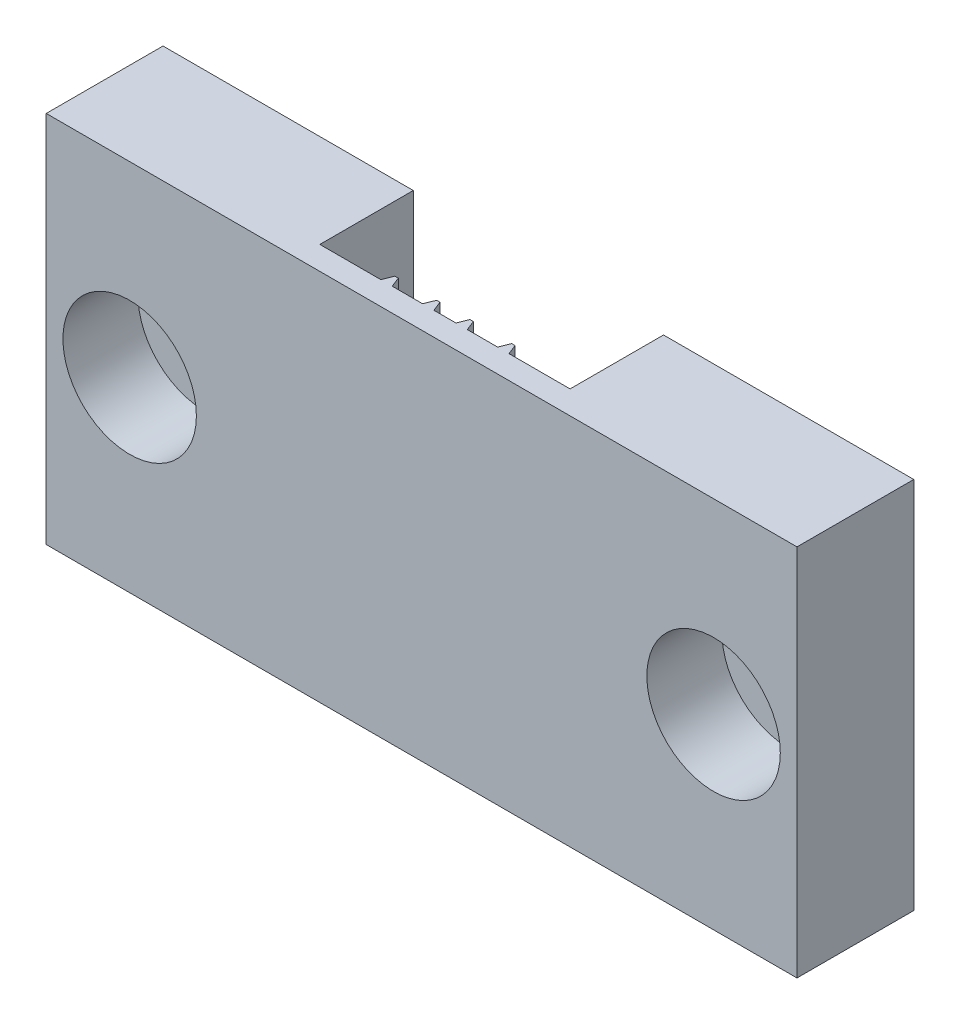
ISO-10303-21;
HEADER;
FILE_DESCRIPTION(('STEP AP214'),'2;1');
FILE_NAME('part.step','',(''),(''),'','','');
FILE_SCHEMA(('AUTOMOTIVE_DESIGN { 1 0 10303 214 1 1 1 1 }'));
ENDSEC;
DATA;
#1=APPLICATION_CONTEXT('core data for automotive mechanical design processes');
#2=APPLICATION_PROTOCOL_DEFINITION('international standard','automotive_design',2000,#1);
#3=PRODUCT_CONTEXT('',#1,'mechanical');
#4=PRODUCT('Part','Part','',(#3));
#5=PRODUCT_RELATED_PRODUCT_CATEGORY('part','',(#4));
#6=PRODUCT_DEFINITION_FORMATION('','',#4);
#7=PRODUCT_DEFINITION_CONTEXT('part definition',#1,'design');
#8=PRODUCT_DEFINITION('design','',#6,#7);
#9=PRODUCT_DEFINITION_SHAPE('','',#8);
#10=(LENGTH_UNIT() NAMED_UNIT(*) SI_UNIT(.MILLI.,.METRE.));
#11=(NAMED_UNIT(*) PLANE_ANGLE_UNIT() SI_UNIT($,.RADIAN.));
#12=(NAMED_UNIT(*) SI_UNIT($,.STERADIAN.) SOLID_ANGLE_UNIT());
#13=UNCERTAINTY_MEASURE_WITH_UNIT(LENGTH_MEASURE(1.E-05),#10,'distance_accuracy_value','');
#14=(GEOMETRIC_REPRESENTATION_CONTEXT(3) GLOBAL_UNCERTAINTY_ASSIGNED_CONTEXT((#13)) GLOBAL_UNIT_ASSIGNED_CONTEXT((#10,
#11,#12)) REPRESENTATION_CONTEXT('',''));
#15=CARTESIAN_POINT('',(0.,0.,0.));
#16=DIRECTION('',(0.,0.,1.));
#17=DIRECTION('',(1.,0.,0.));
#18=AXIS2_PLACEMENT_3D('',#15,#16,#17);
#19=CARTESIAN_POINT('',(45.,1.13686837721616E-13,0.));
#20=DIRECTION('',(0.,0.,1.));
#21=DIRECTION('',(1.,0.,0.));
#22=AXIS2_PLACEMENT_3D('',#19,#20,#21);
#23=PLANE('',#22);
#24=CARTESIAN_POINT('',(5.,11.1800003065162,0.));
#25=DIRECTION('',(0.,0.,1.));
#26=DIRECTION('',(1.,0.,0.));
#27=AXIS2_PLACEMENT_3D('',#24,#25,#26);
#28=CIRCLE('',#27,2.25);
#29=CARTESIAN_POINT('',(7.25,11.1800003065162,0.));
#30=VERTEX_POINT('',#29);
#31=EDGE_CURVE('E232',#30,#30,#28,.T.);
#32=ORIENTED_EDGE('',*,*,#31,.T.);
#33=EDGE_LOOP('',(#32));
#34=FACE_BOUND('',#33,.T.);
#35=DIRECTION('',(0.,1.,0.));
#36=VECTOR('',#35,1.);
#37=CARTESIAN_POINT('',(15.,1.14491749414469E-13,0.));
#38=LINE('',#37,#36);
#39=CARTESIAN_POINT('',(15.,1.14491749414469E-13,0.));
#40=VERTEX_POINT('',#39);
#41=CARTESIAN_POINT('',(15.,22.3800003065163,0.));
#42=VERTEX_POINT('',#41);
#43=EDGE_CURVE('E337',#40,#42,#38,.T.);
#44=ORIENTED_EDGE('',*,*,#43,.F.);
#45=DIRECTION('',(1.,0.,0.));
#46=VECTOR('',#45,1.);
#47=CARTESIAN_POINT('',(0.,1.13686837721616E-13,0.));
#48=LINE('',#47,#46);
#49=CARTESIAN_POINT('',(0.,1.13686837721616E-13,0.));
#50=VERTEX_POINT('',#49);
#51=EDGE_CURVE('E231',#50,#40,#48,.T.);
#52=ORIENTED_EDGE('',*,*,#51,.F.);
#53=DIRECTION('',(0.,-1.,0.));
#54=VECTOR('',#53,1.);
#55=CARTESIAN_POINT('',(0.,1.13686837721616E-13,0.));
#56=LINE('',#55,#54);
#57=CARTESIAN_POINT('',(0.,22.3800003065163,0.));
#58=VERTEX_POINT('',#57);
#59=EDGE_CURVE('E80',#58,#50,#56,.T.);
#60=ORIENTED_EDGE('',*,*,#59,.F.);
#61=DIRECTION('',(-1.,0.,0.));
#62=VECTOR('',#61,1.);
#63=CARTESIAN_POINT('',(0.,22.3800003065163,0.));
#64=LINE('',#63,#62);
#65=EDGE_CURVE('E242',#42,#58,#64,.T.);
#66=ORIENTED_EDGE('',*,*,#65,.F.);
#67=EDGE_LOOP('',(#44,#52,#60,#66));
#68=FACE_BOUND('',#67,.T.);
#69=ADVANCED_FACE('F33',(#34,#68),#23,.F.);
#70=CARTESIAN_POINT('',(40.,11.1800003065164,0.));
#71=DIRECTION('',(0.,0.,1.));
#72=DIRECTION('',(1.,0.,0.));
#73=AXIS2_PLACEMENT_3D('',#70,#71,#72);
#74=CIRCLE('',#73,2.25);
#75=CARTESIAN_POINT('',(42.25,11.1800003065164,0.));
#76=VERTEX_POINT('',#75);
#77=EDGE_CURVE('E236',#76,#76,#74,.T.);
#78=ORIENTED_EDGE('',*,*,#77,.T.);
#79=EDGE_LOOP('',(#78));
#80=FACE_BOUND('',#79,.T.);
#81=DIRECTION('',(0.,1.,0.));
#82=VECTOR('',#81,1.);
#83=CARTESIAN_POINT('',(30.,1.14491749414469E-13,0.));
#84=LINE('',#83,#82);
#85=CARTESIAN_POINT('',(30.,1.14491749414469E-13,0.));
#86=VERTEX_POINT('',#85);
#87=CARTESIAN_POINT('',(30.,22.3800003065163,0.));
#88=VERTEX_POINT('',#87);
#89=EDGE_CURVE('E205',#86,#88,#84,.T.);
#90=ORIENTED_EDGE('',*,*,#89,.T.);
#91=CARTESIAN_POINT('',(45.,22.3800003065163,0.));
#92=VERTEX_POINT('',#91);
#93=EDGE_CURVE('E243',#92,#88,#64,.T.);
#94=ORIENTED_EDGE('',*,*,#93,.F.);
#95=DIRECTION('',(0.,1.,0.));
#96=VECTOR('',#95,1.);
#97=CARTESIAN_POINT('',(45.,1.13686837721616E-13,0.));
#98=LINE('',#97,#96);
#99=CARTESIAN_POINT('',(45.,1.13686837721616E-13,0.));
#100=VERTEX_POINT('',#99);
#101=EDGE_CURVE('E230',#100,#92,#98,.T.);
#102=ORIENTED_EDGE('',*,*,#101,.F.);
#103=EDGE_CURVE('E222',#86,#100,#48,.T.);
#104=ORIENTED_EDGE('',*,*,#103,.F.);
#105=EDGE_LOOP('',(#90,#94,#102,#104));
#106=FACE_BOUND('',#105,.T.);
#107=ADVANCED_FACE('F229',(#80,#106),#23,.F.);
#108=CARTESIAN_POINT('',(0.,1.13686837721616E-13,7.));
#109=DIRECTION('',(0.,1.,0.));
#110=DIRECTION('',(0.,0.,1.));
#111=AXIS2_PLACEMENT_3D('',#108,#109,#110);
#112=PLANE('',#111);
#113=DIRECTION('',(0.,0.,-1.));
#114=VECTOR('',#113,1.);
#115=CARTESIAN_POINT('',(15.,1.14491749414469E-13,5.59999999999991));
#116=LINE('',#115,#114);
#117=CARTESIAN_POINT('',(15.,1.14491749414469E-13,5.59999999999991));
#118=VERTEX_POINT('',#117);
#119=EDGE_CURVE('E217',#118,#40,#116,.T.);
#120=ORIENTED_EDGE('',*,*,#119,.F.);
#121=DIRECTION('',(-1.,0.,-1.24416647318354E-13));
#122=VECTOR('',#121,1.);
#123=CARTESIAN_POINT('',(15.,1.14491749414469E-13,5.59999999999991));
#124=LINE('',#123,#122);
#125=CARTESIAN_POINT('',(18.6599998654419,1.14491749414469E-13,5.60000000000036));
#126=VERTEX_POINT('',#125);
#127=EDGE_CURVE('E745',#126,#118,#124,.T.);
#128=ORIENTED_EDGE('',*,*,#127,.F.);
#129=DIRECTION('',(-0.371390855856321,0.,0.928476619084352));
#130=VECTOR('',#129,1.);
#131=CARTESIAN_POINT('',(18.8999999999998,1.14491749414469E-13,4.99999999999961));
#132=LINE('',#131,#130);
#133=CARTESIAN_POINT('',(18.8999999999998,1.14491749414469E-13,4.99999999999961));
#134=VERTEX_POINT('',#133);
#135=EDGE_CURVE('E740',#134,#126,#132,.T.);
#136=ORIENTED_EDGE('',*,*,#135,.F.);
#137=DIRECTION('',(-1.,0.,0.));
#138=VECTOR('',#137,1.);
#139=CARTESIAN_POINT('',(19.0999999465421,1.14491749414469E-13,4.99999999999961));
#140=LINE('',#139,#138);
#141=CARTESIAN_POINT('',(19.0999999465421,1.14491749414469E-13,4.99999999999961));
#142=VERTEX_POINT('',#141);
#143=EDGE_CURVE('E736',#142,#134,#140,.T.);
#144=ORIENTED_EDGE('',*,*,#143,.F.);
#145=DIRECTION('',(-0.371390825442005,0.,-0.928476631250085));
#146=VECTOR('',#145,1.);
#147=CARTESIAN_POINT('',(19.0999999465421,1.14491749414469E-13,4.99999999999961));
#148=LINE('',#147,#146);
#149=CARTESIAN_POINT('',(19.3400000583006,1.14491749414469E-13,5.59999999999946));
#150=VERTEX_POINT('',#149);
#151=EDGE_CURVE('E749',#150,#142,#148,.T.);
#152=ORIENTED_EDGE('',*,*,#151,.F.);
#153=DIRECTION('',(-1.,0.,0.));
#154=VECTOR('',#153,1.);
#155=CARTESIAN_POINT('',(19.3400000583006,1.14491749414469E-13,5.59999999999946));
#156=LINE('',#155,#154);
#157=CARTESIAN_POINT('',(21.1599998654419,1.14491749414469E-13,5.59999999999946));
#158=VERTEX_POINT('',#157);
#159=EDGE_CURVE('E729',#158,#150,#156,.T.);
#160=ORIENTED_EDGE('',*,*,#159,.F.);
#161=DIRECTION('',(-0.371390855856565,0.,0.928476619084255));
#162=VECTOR('',#161,1.);
#163=CARTESIAN_POINT('',(21.3999999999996,1.14491749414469E-13,4.99999999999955));
#164=LINE('',#163,#162);
#165=CARTESIAN_POINT('',(21.3999999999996,1.14491749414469E-13,4.99999999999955));
#166=VERTEX_POINT('',#165);
#167=EDGE_CURVE('E725',#166,#158,#164,.T.);
#168=ORIENTED_EDGE('',*,*,#167,.F.);
#169=DIRECTION('',(-1.,0.,0.));
#170=VECTOR('',#169,1.);
#171=CARTESIAN_POINT('',(21.3999999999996,1.14491749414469E-13,4.99999999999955));
#172=LINE('',#171,#170);
#173=CARTESIAN_POINT('',(21.5999999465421,1.14491749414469E-13,4.99999999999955));
#174=VERTEX_POINT('',#173);
#175=EDGE_CURVE('E753',#174,#166,#172,.T.);
#176=ORIENTED_EDGE('',*,*,#175,.F.);
#177=DIRECTION('',(-0.371390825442,0.,-0.928476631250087));
#178=VECTOR('',#177,1.);
#179=CARTESIAN_POINT('',(21.5999999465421,1.14491749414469E-13,4.99999999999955));
#180=LINE('',#179,#178);
#181=CARTESIAN_POINT('',(21.8400000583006,1.14491749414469E-13,5.59999999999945));
#182=VERTEX_POINT('',#181);
#183=EDGE_CURVE('E718',#182,#174,#180,.T.);
#184=ORIENTED_EDGE('',*,*,#183,.F.);
#185=DIRECTION('',(-1.,0.,0.));
#186=VECTOR('',#185,1.);
#187=CARTESIAN_POINT('',(21.8400000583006,1.14491749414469E-13,5.59999999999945));
#188=LINE('',#187,#186);
#189=CARTESIAN_POINT('',(23.1599998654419,1.14491749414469E-13,5.59999999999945));
#190=VERTEX_POINT('',#189);
#191=EDGE_CURVE('E714',#190,#182,#188,.T.);
#192=ORIENTED_EDGE('',*,*,#191,.F.);
#193=DIRECTION('',(-0.37139085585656,0.,0.928476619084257));
#194=VECTOR('',#193,1.);
#195=CARTESIAN_POINT('',(23.3999999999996,1.14491749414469E-13,4.99999999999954));
#196=LINE('',#195,#194);
#197=CARTESIAN_POINT('',(23.3999999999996,1.14491749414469E-13,4.99999999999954));
#198=VERTEX_POINT('',#197);
#199=EDGE_CURVE('E757',#198,#190,#196,.T.);
#200=ORIENTED_EDGE('',*,*,#199,.F.);
#201=DIRECTION('',(-1.,0.,0.));
#202=VECTOR('',#201,1.);
#203=CARTESIAN_POINT('',(23.3999999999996,1.14491749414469E-13,4.99999999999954));
#204=LINE('',#203,#202);
#205=CARTESIAN_POINT('',(23.5999999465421,1.14491749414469E-13,4.99999999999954));
#206=VERTEX_POINT('',#205);
#207=EDGE_CURVE('E707',#206,#198,#204,.T.);
#208=ORIENTED_EDGE('',*,*,#207,.F.);
#209=DIRECTION('',(-0.371390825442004,0.,-0.928476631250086));
#210=VECTOR('',#209,1.);
#211=CARTESIAN_POINT('',(23.5999999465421,1.14491749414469E-13,4.99999999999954));
#212=LINE('',#211,#210);
#213=CARTESIAN_POINT('',(23.8400000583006,1.14491749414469E-13,5.59999999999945));
#214=VERTEX_POINT('',#213);
#215=EDGE_CURVE('E703',#214,#206,#212,.T.);
#216=ORIENTED_EDGE('',*,*,#215,.F.);
#217=DIRECTION('',(-1.,0.,0.));
#218=VECTOR('',#217,1.);
#219=CARTESIAN_POINT('',(23.8400000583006,1.14491749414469E-13,5.59999999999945));
#220=LINE('',#219,#218);
#221=CARTESIAN_POINT('',(25.6599998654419,1.14491749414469E-13,5.59999999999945));
#222=VERTEX_POINT('',#221);
#223=EDGE_CURVE('E761',#222,#214,#220,.T.);
#224=ORIENTED_EDGE('',*,*,#223,.F.);
#225=DIRECTION('',(-0.37139085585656,0.,0.928476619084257));
#226=VECTOR('',#225,1.);
#227=CARTESIAN_POINT('',(25.8999999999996,1.14491749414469E-13,4.99999999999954));
#228=LINE('',#227,#226);
#229=CARTESIAN_POINT('',(25.8999999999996,1.14491749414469E-13,4.99999999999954));
#230=VERTEX_POINT('',#229);
#231=EDGE_CURVE('E696',#230,#222,#228,.T.);
#232=ORIENTED_EDGE('',*,*,#231,.F.);
#233=DIRECTION('',(-1.,0.,0.));
#234=VECTOR('',#233,1.);
#235=CARTESIAN_POINT('',(25.8999999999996,1.14491749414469E-13,4.99999999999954));
#236=LINE('',#235,#234);
#237=CARTESIAN_POINT('',(26.0999999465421,1.14491749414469E-13,4.99999999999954));
#238=VERTEX_POINT('',#237);
#239=EDGE_CURVE('E692',#238,#230,#236,.T.);
#240=ORIENTED_EDGE('',*,*,#239,.F.);
#241=DIRECTION('',(-0.371390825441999,0.,-0.928476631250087));
#242=VECTOR('',#241,1.);
#243=CARTESIAN_POINT('',(26.0999999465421,1.14491749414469E-13,4.99999999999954));
#244=LINE('',#243,#242);
#245=CARTESIAN_POINT('',(26.3400000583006,1.14491749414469E-13,5.59999999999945));
#246=VERTEX_POINT('',#245);
#247=EDGE_CURVE('E765',#246,#238,#244,.T.);
#248=ORIENTED_EDGE('',*,*,#247,.F.);
#249=DIRECTION('',(-1.,0.,-1.24179660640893E-13));
#250=VECTOR('',#249,1.);
#251=CARTESIAN_POINT('',(26.3400000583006,1.14491749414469E-13,5.59999999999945));
#252=LINE('',#251,#250);
#253=CARTESIAN_POINT('',(30.,1.14491749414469E-13,5.59999999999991));
#254=VERTEX_POINT('',#253);
#255=EDGE_CURVE('E226',#254,#246,#252,.T.);
#256=ORIENTED_EDGE('',*,*,#255,.F.);
#257=DIRECTION('',(0.,0.,1.));
#258=VECTOR('',#257,1.);
#259=CARTESIAN_POINT('',(30.,1.14491749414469E-13,5.59999999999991));
#260=LINE('',#259,#258);
#261=EDGE_CURVE('E208',#86,#254,#260,.T.);
#262=ORIENTED_EDGE('',*,*,#261,.F.);
#263=ORIENTED_EDGE('',*,*,#103,.T.);
#264=DIRECTION('',(0.,0.,-1.));
#265=VECTOR('',#264,1.);
#266=CARTESIAN_POINT('',(45.,1.13686837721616E-13,7.));
#267=LINE('',#266,#265);
#268=CARTESIAN_POINT('',(45.,1.13686837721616E-13,7.));
#269=VERTEX_POINT('',#268);
#270=EDGE_CURVE('E12',#269,#100,#267,.T.);
#271=ORIENTED_EDGE('',*,*,#270,.F.);
#272=DIRECTION('',(1.,0.,0.));
#273=VECTOR('',#272,1.);
#274=CARTESIAN_POINT('',(0.,1.13686837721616E-13,7.));
#275=LINE('',#274,#273);
#276=CARTESIAN_POINT('',(0.,1.13686837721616E-13,7.));
#277=VERTEX_POINT('',#276);
#278=EDGE_CURVE('E246',#277,#269,#275,.T.);
#279=ORIENTED_EDGE('',*,*,#278,.F.);
#280=DIRECTION('',(0.,0.,-1.));
#281=VECTOR('',#280,1.);
#282=CARTESIAN_POINT('',(0.,1.13686837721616E-13,7.));
#283=LINE('',#282,#281);
#284=EDGE_CURVE('E247',#277,#50,#283,.T.);
#285=ORIENTED_EDGE('',*,*,#284,.T.);
#286=ORIENTED_EDGE('',*,*,#51,.T.);
#287=EDGE_LOOP('',(#120,#128,#136,#144,#152,#160,#168,#176,#184,#192,#200,#208,#216,#224,#232,
#240,#248,#256,#262,#263,#271,#279,#285,#286));
#288=FACE_BOUND('',#287,.T.);
#289=ADVANCED_FACE('F35',(#288),#112,.F.);
#290=CARTESIAN_POINT('',(0.,22.3800003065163,7.));
#291=DIRECTION('',(0.,-1.,0.));
#292=DIRECTION('',(0.,0.,-1.));
#293=AXIS2_PLACEMENT_3D('',#290,#291,#292);
#294=PLANE('',#293);
#295=DIRECTION('',(0.,0.,-1.));
#296=VECTOR('',#295,1.);
#297=CARTESIAN_POINT('',(15.,22.3800003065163,5.59999999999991));
#298=LINE('',#297,#296);
#299=CARTESIAN_POINT('',(15.,22.3800003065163,5.59999999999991));
#300=VERTEX_POINT('',#299);
#301=EDGE_CURVE('E227',#300,#42,#298,.T.);
#302=ORIENTED_EDGE('',*,*,#301,.T.);
#303=ORIENTED_EDGE('',*,*,#65,.T.);
#304=DIRECTION('',(0.,0.,-1.));
#305=VECTOR('',#304,1.);
#306=CARTESIAN_POINT('',(0.,22.3800003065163,7.));
#307=LINE('',#306,#305);
#308=CARTESIAN_POINT('',(0.,22.3800003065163,7.));
#309=VERTEX_POINT('',#308);
#310=EDGE_CURVE('E249',#309,#58,#307,.T.);
#311=ORIENTED_EDGE('',*,*,#310,.F.);
#312=DIRECTION('',(-1.,0.,0.));
#313=VECTOR('',#312,1.);
#314=CARTESIAN_POINT('',(0.,22.3800003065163,7.));
#315=LINE('',#314,#313);
#316=CARTESIAN_POINT('',(45.,22.3800003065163,7.));
#317=VERTEX_POINT('',#316);
#318=EDGE_CURVE('E271',#317,#309,#315,.T.);
#319=ORIENTED_EDGE('',*,*,#318,.F.);
#320=DIRECTION('',(0.,0.,-1.));
#321=VECTOR('',#320,1.);
#322=CARTESIAN_POINT('',(45.,22.3800003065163,7.));
#323=LINE('',#322,#321);
#324=EDGE_CURVE('E42',#317,#92,#323,.T.);
#325=ORIENTED_EDGE('',*,*,#324,.T.);
#326=ORIENTED_EDGE('',*,*,#93,.T.);
#327=DIRECTION('',(0.,0.,1.));
#328=VECTOR('',#327,1.);
#329=CARTESIAN_POINT('',(30.,22.3800003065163,5.59999999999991));
#330=LINE('',#329,#328);
#331=CARTESIAN_POINT('',(30.,22.3800003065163,5.59999999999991));
#332=VERTEX_POINT('',#331);
#333=EDGE_CURVE('E211',#88,#332,#330,.T.);
#334=ORIENTED_EDGE('',*,*,#333,.T.);
#335=DIRECTION('',(-1.,0.,-1.24179660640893E-13));
#336=VECTOR('',#335,1.);
#337=CARTESIAN_POINT('',(26.3400000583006,22.3800003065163,5.59999999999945));
#338=LINE('',#337,#336);
#339=CARTESIAN_POINT('',(26.3400000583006,22.3800003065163,5.59999999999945));
#340=VERTEX_POINT('',#339);
#341=EDGE_CURVE('E50',#332,#340,#338,.T.);
#342=ORIENTED_EDGE('',*,*,#341,.T.);
#343=DIRECTION('',(-0.371390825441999,0.,-0.928476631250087));
#344=VECTOR('',#343,1.);
#345=CARTESIAN_POINT('',(26.0999999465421,22.3800003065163,4.99999999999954));
#346=LINE('',#345,#344);
#347=CARTESIAN_POINT('',(26.0999999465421,22.3800003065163,4.99999999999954));
#348=VERTEX_POINT('',#347);
#349=EDGE_CURVE('E285',#340,#348,#346,.T.);
#350=ORIENTED_EDGE('',*,*,#349,.T.);
#351=DIRECTION('',(-1.,0.,0.));
#352=VECTOR('',#351,1.);
#353=CARTESIAN_POINT('',(25.8999999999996,22.3800003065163,4.99999999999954));
#354=LINE('',#353,#352);
#355=CARTESIAN_POINT('',(25.8999999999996,22.3800003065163,4.99999999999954));
#356=VERTEX_POINT('',#355);
#357=EDGE_CURVE('E291',#348,#356,#354,.T.);
#358=ORIENTED_EDGE('',*,*,#357,.T.);
#359=DIRECTION('',(-0.37139085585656,0.,0.928476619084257));
#360=VECTOR('',#359,1.);
#361=CARTESIAN_POINT('',(25.8999999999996,22.3800003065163,4.99999999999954));
#362=LINE('',#361,#360);
#363=CARTESIAN_POINT('',(25.6599998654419,22.3800003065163,5.59999999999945));
#364=VERTEX_POINT('',#363);
#365=EDGE_CURVE('E294',#356,#364,#362,.T.);
#366=ORIENTED_EDGE('',*,*,#365,.T.);
#367=DIRECTION('',(-1.,0.,0.));
#368=VECTOR('',#367,1.);
#369=CARTESIAN_POINT('',(23.8400000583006,22.3800003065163,5.59999999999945));
#370=LINE('',#369,#368);
#371=CARTESIAN_POINT('',(23.8400000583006,22.3800003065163,5.59999999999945));
#372=VERTEX_POINT('',#371);
#373=EDGE_CURVE('E297',#364,#372,#370,.T.);
#374=ORIENTED_EDGE('',*,*,#373,.T.);
#375=DIRECTION('',(-0.371390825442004,0.,-0.928476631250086));
#376=VECTOR('',#375,1.);
#377=CARTESIAN_POINT('',(23.5999999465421,22.3800003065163,4.99999999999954));
#378=LINE('',#377,#376);
#379=CARTESIAN_POINT('',(23.5999999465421,22.3800003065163,4.99999999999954));
#380=VERTEX_POINT('',#379);
#381=EDGE_CURVE('E300',#372,#380,#378,.T.);
#382=ORIENTED_EDGE('',*,*,#381,.T.);
#383=DIRECTION('',(-1.,0.,0.));
#384=VECTOR('',#383,1.);
#385=CARTESIAN_POINT('',(23.3999999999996,22.3800003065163,4.99999999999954));
#386=LINE('',#385,#384);
#387=CARTESIAN_POINT('',(23.3999999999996,22.3800003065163,4.99999999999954));
#388=VERTEX_POINT('',#387);
#389=EDGE_CURVE('E303',#380,#388,#386,.T.);
#390=ORIENTED_EDGE('',*,*,#389,.T.);
#391=DIRECTION('',(-0.37139085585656,0.,0.928476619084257));
#392=VECTOR('',#391,1.);
#393=CARTESIAN_POINT('',(23.3999999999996,22.3800003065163,4.99999999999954));
#394=LINE('',#393,#392);
#395=CARTESIAN_POINT('',(23.1599998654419,22.3800003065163,5.59999999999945));
#396=VERTEX_POINT('',#395);
#397=EDGE_CURVE('E306',#388,#396,#394,.T.);
#398=ORIENTED_EDGE('',*,*,#397,.T.);
#399=DIRECTION('',(-1.,0.,0.));
#400=VECTOR('',#399,1.);
#401=CARTESIAN_POINT('',(21.8400000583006,22.3800003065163,5.59999999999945));
#402=LINE('',#401,#400);
#403=CARTESIAN_POINT('',(21.8400000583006,22.3800003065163,5.59999999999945));
#404=VERTEX_POINT('',#403);
#405=EDGE_CURVE('E309',#396,#404,#402,.T.);
#406=ORIENTED_EDGE('',*,*,#405,.T.);
#407=DIRECTION('',(-0.371390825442,0.,-0.928476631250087));
#408=VECTOR('',#407,1.);
#409=CARTESIAN_POINT('',(21.5999999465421,22.3800003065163,4.99999999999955));
#410=LINE('',#409,#408);
#411=CARTESIAN_POINT('',(21.5999999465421,22.3800003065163,4.99999999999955));
#412=VERTEX_POINT('',#411);
#413=EDGE_CURVE('E312',#404,#412,#410,.T.);
#414=ORIENTED_EDGE('',*,*,#413,.T.);
#415=DIRECTION('',(-1.,0.,0.));
#416=VECTOR('',#415,1.);
#417=CARTESIAN_POINT('',(21.3999999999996,22.3800003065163,4.99999999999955));
#418=LINE('',#417,#416);
#419=CARTESIAN_POINT('',(21.3999999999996,22.3800003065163,4.99999999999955));
#420=VERTEX_POINT('',#419);
#421=EDGE_CURVE('E315',#412,#420,#418,.T.);
#422=ORIENTED_EDGE('',*,*,#421,.T.);
#423=DIRECTION('',(-0.371390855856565,0.,0.928476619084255));
#424=VECTOR('',#423,1.);
#425=CARTESIAN_POINT('',(21.3999999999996,22.3800003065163,4.99999999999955));
#426=LINE('',#425,#424);
#427=CARTESIAN_POINT('',(21.1599998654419,22.3800003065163,5.59999999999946));
#428=VERTEX_POINT('',#427);
#429=EDGE_CURVE('E318',#420,#428,#426,.T.);
#430=ORIENTED_EDGE('',*,*,#429,.T.);
#431=DIRECTION('',(-1.,0.,0.));
#432=VECTOR('',#431,1.);
#433=CARTESIAN_POINT('',(19.3400000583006,22.3800003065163,5.59999999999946));
#434=LINE('',#433,#432);
#435=CARTESIAN_POINT('',(19.3400000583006,22.3800003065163,5.59999999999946));
#436=VERTEX_POINT('',#435);
#437=EDGE_CURVE('E321',#428,#436,#434,.T.);
#438=ORIENTED_EDGE('',*,*,#437,.T.);
#439=DIRECTION('',(-0.371390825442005,0.,-0.928476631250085));
#440=VECTOR('',#439,1.);
#441=CARTESIAN_POINT('',(19.0999999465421,22.3800003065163,4.99999999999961));
#442=LINE('',#441,#440);
#443=CARTESIAN_POINT('',(19.0999999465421,22.3800003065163,4.99999999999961));
#444=VERTEX_POINT('',#443);
#445=EDGE_CURVE('E324',#436,#444,#442,.T.);
#446=ORIENTED_EDGE('',*,*,#445,.T.);
#447=DIRECTION('',(-1.,0.,0.));
#448=VECTOR('',#447,1.);
#449=CARTESIAN_POINT('',(19.0999999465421,22.3800003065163,4.99999999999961));
#450=LINE('',#449,#448);
#451=CARTESIAN_POINT('',(18.8999999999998,22.3800003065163,4.99999999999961));
#452=VERTEX_POINT('',#451);
#453=EDGE_CURVE('E327',#444,#452,#450,.T.);
#454=ORIENTED_EDGE('',*,*,#453,.T.);
#455=DIRECTION('',(-0.371390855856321,0.,0.928476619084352));
#456=VECTOR('',#455,1.);
#457=CARTESIAN_POINT('',(18.8999999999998,22.3800003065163,4.99999999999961));
#458=LINE('',#457,#456);
#459=CARTESIAN_POINT('',(18.6599998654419,22.3800003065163,5.60000000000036));
#460=VERTEX_POINT('',#459);
#461=EDGE_CURVE('E330',#452,#460,#458,.T.);
#462=ORIENTED_EDGE('',*,*,#461,.T.);
#463=DIRECTION('',(-1.,0.,-1.24416647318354E-13));
#464=VECTOR('',#463,1.);
#465=CARTESIAN_POINT('',(15.,22.3800003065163,5.59999999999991));
#466=LINE('',#465,#464);
#467=EDGE_CURVE('E333',#460,#300,#466,.T.);
#468=ORIENTED_EDGE('',*,*,#467,.T.);
#469=EDGE_LOOP('',(#302,#303,#311,#319,#325,#326,#334,#342,#350,#358,#366,#374,#382,#390,#398,
#406,#414,#422,#430,#438,#446,#454,#462,#468));
#470=FACE_BOUND('',#469,.T.);
#471=ADVANCED_FACE('F277',(#470),#294,.F.);
#472=CARTESIAN_POINT('',(40.,11.1800003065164,7.));
#473=DIRECTION('',(0.,0.,-1.));
#474=DIRECTION('',(-1.,0.,0.));
#475=AXIS2_PLACEMENT_3D('',#472,#473,#474);
#476=CYLINDRICAL_SURFACE('',#475,2.25);
#477=ORIENTED_EDGE('',*,*,#77,.F.);
#478=EDGE_LOOP('',(#477));
#479=FACE_BOUND('',#478,.T.);
#480=CARTESIAN_POINT('',(40.,11.1800003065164,2.5));
#481=DIRECTION('',(0.,0.,1.));
#482=DIRECTION('',(1.,0.,0.));
#483=AXIS2_PLACEMENT_3D('',#480,#481,#482);
#484=CIRCLE('',#483,2.25);
#485=CARTESIAN_POINT('',(42.25,11.1800003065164,2.5));
#486=VERTEX_POINT('',#485);
#487=EDGE_CURVE('E37',#486,#486,#484,.T.);
#488=ORIENTED_EDGE('',*,*,#487,.T.);
#489=EDGE_LOOP('',(#488));
#490=FACE_BOUND('',#489,.T.);
#491=ADVANCED_FACE('F413',(#479,#490),#476,.F.);
#492=CARTESIAN_POINT('',(5.,11.1800003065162,7.));
#493=DIRECTION('',(0.,0.,-1.));
#494=DIRECTION('',(-1.,0.,0.));
#495=AXIS2_PLACEMENT_3D('',#492,#493,#494);
#496=CYLINDRICAL_SURFACE('',#495,2.25);
#497=ORIENTED_EDGE('',*,*,#31,.F.);
#498=EDGE_LOOP('',(#497));
#499=FACE_BOUND('',#498,.T.);
#500=CARTESIAN_POINT('',(5.,11.1800003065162,2.5));
#501=DIRECTION('',(0.,0.,1.));
#502=DIRECTION('',(1.,0.,0.));
#503=AXIS2_PLACEMENT_3D('',#500,#501,#502);
#504=CIRCLE('',#503,2.25);
#505=CARTESIAN_POINT('',(7.25,11.1800003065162,2.5));
#506=VERTEX_POINT('',#505);
#507=EDGE_CURVE('E252',#506,#506,#504,.T.);
#508=ORIENTED_EDGE('',*,*,#507,.T.);
#509=EDGE_LOOP('',(#508));
#510=FACE_BOUND('',#509,.T.);
#511=ADVANCED_FACE('F385',(#499,#510),#496,.F.);
#512=CARTESIAN_POINT('',(45.,1.13686837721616E-13,7.));
#513=DIRECTION('',(0.,0.,1.));
#514=DIRECTION('',(1.,0.,0.));
#515=AXIS2_PLACEMENT_3D('',#512,#513,#514);
#516=PLANE('',#515);
#517=CARTESIAN_POINT('',(40.,11.1800003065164,7.));
#518=DIRECTION('',(0.,0.,1.));
#519=DIRECTION('',(1.,0.,0.));
#520=AXIS2_PLACEMENT_3D('',#517,#518,#519);
#521=CIRCLE('',#520,4.);
#522=CARTESIAN_POINT('',(44.,11.1800003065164,7.));
#523=VERTEX_POINT('',#522);
#524=EDGE_CURVE('E267',#523,#523,#521,.T.);
#525=ORIENTED_EDGE('',*,*,#524,.F.);
#526=EDGE_LOOP('',(#525));
#527=FACE_BOUND('',#526,.T.);
#528=CARTESIAN_POINT('',(5.,11.1800003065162,7.));
#529=DIRECTION('',(0.,0.,1.));
#530=DIRECTION('',(1.,0.,0.));
#531=AXIS2_PLACEMENT_3D('',#528,#529,#530);
#532=CIRCLE('',#531,4.);
#533=CARTESIAN_POINT('',(9.,11.1800003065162,7.));
#534=VERTEX_POINT('',#533);
#535=EDGE_CURVE('E260',#534,#534,#532,.T.);
#536=ORIENTED_EDGE('',*,*,#535,.F.);
#537=EDGE_LOOP('',(#536));
#538=FACE_BOUND('',#537,.T.);
#539=ORIENTED_EDGE('',*,*,#278,.T.);
#540=DIRECTION('',(0.,1.,0.));
#541=VECTOR('',#540,1.);
#542=CARTESIAN_POINT('',(45.,1.13686837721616E-13,7.));
#543=LINE('',#542,#541);
#544=EDGE_CURVE('E87',#269,#317,#543,.T.);
#545=ORIENTED_EDGE('',*,*,#544,.T.);
#546=ORIENTED_EDGE('',*,*,#318,.T.);
#547=DIRECTION('',(0.,-1.,0.));
#548=VECTOR('',#547,1.);
#549=CARTESIAN_POINT('',(0.,1.13686837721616E-13,7.));
#550=LINE('',#549,#548);
#551=EDGE_CURVE('E59',#309,#277,#550,.T.);
#552=ORIENTED_EDGE('',*,*,#551,.T.);
#553=EDGE_LOOP('',(#539,#545,#546,#552));
#554=FACE_BOUND('',#553,.T.);
#555=ADVANCED_FACE('F274',(#527,#538,#554),#516,.T.);
#556=CARTESIAN_POINT('',(45.,1.13686837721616E-13,7.));
#557=DIRECTION('',(-1.,0.,0.));
#558=DIRECTION('',(0.,0.,1.));
#559=AXIS2_PLACEMENT_3D('',#556,#557,#558);
#560=PLANE('',#559);
#561=ORIENTED_EDGE('',*,*,#101,.T.);
#562=ORIENTED_EDGE('',*,*,#324,.F.);
#563=ORIENTED_EDGE('',*,*,#544,.F.);
#564=ORIENTED_EDGE('',*,*,#270,.T.);
#565=EDGE_LOOP('',(#561,#562,#563,#564));
#566=FACE_BOUND('',#565,.T.);
#567=ADVANCED_FACE('F282',(#566),#560,.F.);
#568=CARTESIAN_POINT('',(0.,1.13686837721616E-13,7.));
#569=DIRECTION('',(1.,0.,0.));
#570=DIRECTION('',(0.,0.,-1.));
#571=AXIS2_PLACEMENT_3D('',#568,#569,#570);
#572=PLANE('',#571);
#573=ORIENTED_EDGE('',*,*,#59,.T.);
#574=ORIENTED_EDGE('',*,*,#284,.F.);
#575=ORIENTED_EDGE('',*,*,#551,.F.);
#576=ORIENTED_EDGE('',*,*,#310,.T.);
#577=EDGE_LOOP('',(#573,#574,#575,#576));
#578=FACE_BOUND('',#577,.T.);
#579=ADVANCED_FACE('F279',(#578),#572,.F.);
#580=CARTESIAN_POINT('',(5.,11.1800003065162,2.5));
#581=DIRECTION('',(0.,0.,1.));
#582=DIRECTION('',(1.,0.,0.));
#583=AXIS2_PLACEMENT_3D('',#580,#581,#582);
#584=CYLINDRICAL_SURFACE('',#583,4.);
#585=CARTESIAN_POINT('',(5.,11.1800003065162,2.5));
#586=DIRECTION('',(0.,0.,1.));
#587=DIRECTION('',(1.,0.,0.));
#588=AXIS2_PLACEMENT_3D('',#585,#586,#587);
#589=CIRCLE('',#588,4.);
#590=CARTESIAN_POINT('',(9.,11.1800003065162,2.5));
#591=VERTEX_POINT('',#590);
#592=EDGE_CURVE('E254',#591,#591,#589,.T.);
#593=ORIENTED_EDGE('',*,*,#592,.F.);
#594=EDGE_LOOP('',(#593));
#595=FACE_BOUND('',#594,.T.);
#596=ORIENTED_EDGE('',*,*,#535,.T.);
#597=EDGE_LOOP('',(#596));
#598=FACE_BOUND('',#597,.T.);
#599=ADVANCED_FACE('F389',(#595,#598),#584,.F.);
#600=CARTESIAN_POINT('',(5.,11.1800003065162,2.5));
#601=DIRECTION('',(0.,0.,1.));
#602=DIRECTION('',(1.,0.,0.));
#603=AXIS2_PLACEMENT_3D('',#600,#601,#602);
#604=PLANE('',#603);
#605=ORIENTED_EDGE('',*,*,#507,.F.);
#606=EDGE_LOOP('',(#605));
#607=FACE_BOUND('',#606,.T.);
#608=ORIENTED_EDGE('',*,*,#592,.T.);
#609=EDGE_LOOP('',(#608));
#610=FACE_BOUND('',#609,.T.);
#611=ADVANCED_FACE('F391',(#607,#610),#604,.T.);
#612=CARTESIAN_POINT('',(40.,11.1800003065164,2.5));
#613=DIRECTION('',(0.,0.,1.));
#614=DIRECTION('',(1.,0.,0.));
#615=AXIS2_PLACEMENT_3D('',#612,#613,#614);
#616=CYLINDRICAL_SURFACE('',#615,4.);
#617=CARTESIAN_POINT('',(40.,11.1800003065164,2.5));
#618=DIRECTION('',(0.,0.,1.));
#619=DIRECTION('',(1.,0.,0.));
#620=AXIS2_PLACEMENT_3D('',#617,#618,#619);
#621=CIRCLE('',#620,4.);
#622=CARTESIAN_POINT('',(44.,11.1800003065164,2.5));
#623=VERTEX_POINT('',#622);
#624=EDGE_CURVE('E373',#623,#623,#621,.T.);
#625=ORIENTED_EDGE('',*,*,#624,.F.);
#626=EDGE_LOOP('',(#625));
#627=FACE_BOUND('',#626,.T.);
#628=ORIENTED_EDGE('',*,*,#524,.T.);
#629=EDGE_LOOP('',(#628));
#630=FACE_BOUND('',#629,.T.);
#631=ADVANCED_FACE('F381',(#627,#630),#616,.F.);
#632=CARTESIAN_POINT('',(40.,11.1800003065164,2.5));
#633=DIRECTION('',(0.,0.,1.));
#634=DIRECTION('',(1.,0.,0.));
#635=AXIS2_PLACEMENT_3D('',#632,#633,#634);
#636=PLANE('',#635);
#637=ORIENTED_EDGE('',*,*,#487,.F.);
#638=EDGE_LOOP('',(#637));
#639=FACE_BOUND('',#638,.T.);
#640=ORIENTED_EDGE('',*,*,#624,.T.);
#641=EDGE_LOOP('',(#640));
#642=FACE_BOUND('',#641,.T.);
#643=ADVANCED_FACE('F462',(#639,#642),#636,.T.);
#644=CARTESIAN_POINT('',(15.,1.14491749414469E-13,5.59999999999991));
#645=DIRECTION('',(1.,0.,0.));
#646=DIRECTION('',(0.,0.,-1.));
#647=AXIS2_PLACEMENT_3D('',#644,#645,#646);
#648=PLANE('',#647);
#649=ORIENTED_EDGE('',*,*,#301,.F.);
#650=DIRECTION('',(0.,1.,0.));
#651=VECTOR('',#650,1.);
#652=CARTESIAN_POINT('',(15.,1.14491749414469E-13,5.59999999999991));
#653=LINE('',#652,#651);
#654=EDGE_CURVE('E339',#118,#300,#653,.T.);
#655=ORIENTED_EDGE('',*,*,#654,.F.);
#656=ORIENTED_EDGE('',*,*,#119,.T.);
#657=ORIENTED_EDGE('',*,*,#43,.T.);
#658=EDGE_LOOP('',(#649,#655,#656,#657));
#659=FACE_BOUND('',#658,.T.);
#660=ADVANCED_FACE('F471',(#659),#648,.T.);
#661=CARTESIAN_POINT('',(15.,1.14491749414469E-13,5.59999999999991));
#662=DIRECTION('',(1.24416647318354E-13,0.,-1.));
#663=DIRECTION('',(-1.,0.,-1.24416647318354E-13));
#664=AXIS2_PLACEMENT_3D('',#661,#662,#663);
#665=PLANE('',#664);
#666=ORIENTED_EDGE('',*,*,#467,.F.);
#667=DIRECTION('',(0.,1.,0.));
#668=VECTOR('',#667,1.);
#669=CARTESIAN_POINT('',(18.6599998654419,1.14491749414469E-13,5.60000000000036));
#670=LINE('',#669,#668);
#671=EDGE_CURVE('E341',#126,#460,#670,.T.);
#672=ORIENTED_EDGE('',*,*,#671,.F.);
#673=ORIENTED_EDGE('',*,*,#127,.T.);
#674=ORIENTED_EDGE('',*,*,#654,.T.);
#675=EDGE_LOOP('',(#666,#672,#673,#674));
#676=FACE_BOUND('',#675,.T.);
#677=ADVANCED_FACE('F505',(#676),#665,.T.);
#678=CARTESIAN_POINT('',(18.8999999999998,1.14491749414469E-13,4.99999999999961));
#679=DIRECTION('',(-0.928476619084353,0.,-0.371390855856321));
#680=DIRECTION('',(-0.371390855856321,0.,0.928476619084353));
#681=AXIS2_PLACEMENT_3D('',#678,#679,#680);
#682=PLANE('',#681);
#683=ORIENTED_EDGE('',*,*,#461,.F.);
#684=DIRECTION('',(0.,1.,0.));
#685=VECTOR('',#684,1.);
#686=CARTESIAN_POINT('',(18.8999999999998,1.14491749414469E-13,4.99999999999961));
#687=LINE('',#686,#685);
#688=EDGE_CURVE('E343',#134,#452,#687,.T.);
#689=ORIENTED_EDGE('',*,*,#688,.F.);
#690=ORIENTED_EDGE('',*,*,#135,.T.);
#691=ORIENTED_EDGE('',*,*,#671,.T.);
#692=EDGE_LOOP('',(#683,#689,#690,#691));
#693=FACE_BOUND('',#692,.T.);
#694=ADVANCED_FACE('F515',(#693),#682,.T.);
#695=CARTESIAN_POINT('',(19.0999999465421,1.14491749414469E-13,4.99999999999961));
#696=DIRECTION('',(0.,0.,-1.));
#697=DIRECTION('',(-1.,0.,0.));
#698=AXIS2_PLACEMENT_3D('',#695,#696,#697);
#699=PLANE('',#698);
#700=ORIENTED_EDGE('',*,*,#453,.F.);
#701=DIRECTION('',(0.,1.,0.));
#702=VECTOR('',#701,1.);
#703=CARTESIAN_POINT('',(19.0999999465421,1.14491749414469E-13,4.99999999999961));
#704=LINE('',#703,#702);
#705=EDGE_CURVE('E345',#142,#444,#704,.T.);
#706=ORIENTED_EDGE('',*,*,#705,.F.);
#707=ORIENTED_EDGE('',*,*,#143,.T.);
#708=ORIENTED_EDGE('',*,*,#688,.T.);
#709=EDGE_LOOP('',(#700,#706,#707,#708));
#710=FACE_BOUND('',#709,.T.);
#711=ADVANCED_FACE('F525',(#710),#699,.T.);
#712=CARTESIAN_POINT('',(19.0999999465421,1.14491749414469E-13,4.99999999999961));
#713=DIRECTION('',(0.928476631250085,0.,-0.371390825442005));
#714=DIRECTION('',(-0.371390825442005,0.,-0.928476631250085));
#715=AXIS2_PLACEMENT_3D('',#712,#713,#714);
#716=PLANE('',#715);
#717=ORIENTED_EDGE('',*,*,#445,.F.);
#718=DIRECTION('',(0.,1.,0.));
#719=VECTOR('',#718,1.);
#720=CARTESIAN_POINT('',(19.3400000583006,1.14491749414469E-13,5.59999999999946));
#721=LINE('',#720,#719);
#722=EDGE_CURVE('E347',#150,#436,#721,.T.);
#723=ORIENTED_EDGE('',*,*,#722,.F.);
#724=ORIENTED_EDGE('',*,*,#151,.T.);
#725=ORIENTED_EDGE('',*,*,#705,.T.);
#726=EDGE_LOOP('',(#717,#723,#724,#725));
#727=FACE_BOUND('',#726,.T.);
#728=ADVANCED_FACE('F535',(#727),#716,.T.);
#729=CARTESIAN_POINT('',(19.3400000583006,1.14491749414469E-13,5.59999999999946));
#730=DIRECTION('',(0.,0.,-1.));
#731=DIRECTION('',(-1.,0.,0.));
#732=AXIS2_PLACEMENT_3D('',#729,#730,#731);
#733=PLANE('',#732);
#734=ORIENTED_EDGE('',*,*,#437,.F.);
#735=DIRECTION('',(0.,1.,0.));
#736=VECTOR('',#735,1.);
#737=CARTESIAN_POINT('',(21.1599998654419,1.14491749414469E-13,5.59999999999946));
#738=LINE('',#737,#736);
#739=EDGE_CURVE('E349',#158,#428,#738,.T.);
#740=ORIENTED_EDGE('',*,*,#739,.F.);
#741=ORIENTED_EDGE('',*,*,#159,.T.);
#742=ORIENTED_EDGE('',*,*,#722,.T.);
#743=EDGE_LOOP('',(#734,#740,#741,#742));
#744=FACE_BOUND('',#743,.T.);
#745=ADVANCED_FACE('F545',(#744),#733,.T.);
#746=CARTESIAN_POINT('',(21.3999999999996,1.14491749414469E-13,4.99999999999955));
#747=DIRECTION('',(-0.928476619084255,0.,-0.371390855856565));
#748=DIRECTION('',(-0.371390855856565,0.,0.928476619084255));
#749=AXIS2_PLACEMENT_3D('',#746,#747,#748);
#750=PLANE('',#749);
#751=ORIENTED_EDGE('',*,*,#429,.F.);
#752=DIRECTION('',(0.,1.,0.));
#753=VECTOR('',#752,1.);
#754=CARTESIAN_POINT('',(21.3999999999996,1.14491749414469E-13,4.99999999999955));
#755=LINE('',#754,#753);
#756=EDGE_CURVE('E351',#166,#420,#755,.T.);
#757=ORIENTED_EDGE('',*,*,#756,.F.);
#758=ORIENTED_EDGE('',*,*,#167,.T.);
#759=ORIENTED_EDGE('',*,*,#739,.T.);
#760=EDGE_LOOP('',(#751,#757,#758,#759));
#761=FACE_BOUND('',#760,.T.);
#762=ADVANCED_FACE('F555',(#761),#750,.T.);
#763=CARTESIAN_POINT('',(21.3999999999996,1.14491749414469E-13,4.99999999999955));
#764=DIRECTION('',(0.,0.,-1.));
#765=DIRECTION('',(-1.,0.,0.));
#766=AXIS2_PLACEMENT_3D('',#763,#764,#765);
#767=PLANE('',#766);
#768=ORIENTED_EDGE('',*,*,#421,.F.);
#769=DIRECTION('',(0.,1.,0.));
#770=VECTOR('',#769,1.);
#771=CARTESIAN_POINT('',(21.5999999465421,1.14491749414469E-13,4.99999999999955));
#772=LINE('',#771,#770);
#773=EDGE_CURVE('E353',#174,#412,#772,.T.);
#774=ORIENTED_EDGE('',*,*,#773,.F.);
#775=ORIENTED_EDGE('',*,*,#175,.T.);
#776=ORIENTED_EDGE('',*,*,#756,.T.);
#777=EDGE_LOOP('',(#768,#774,#775,#776));
#778=FACE_BOUND('',#777,.T.);
#779=ADVANCED_FACE('F565',(#778),#767,.T.);
#780=CARTESIAN_POINT('',(21.5999999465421,1.14491749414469E-13,4.99999999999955));
#781=DIRECTION('',(0.928476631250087,0.,-0.371390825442));
#782=DIRECTION('',(-0.371390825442,0.,-0.928476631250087));
#783=AXIS2_PLACEMENT_3D('',#780,#781,#782);
#784=PLANE('',#783);
#785=ORIENTED_EDGE('',*,*,#413,.F.);
#786=DIRECTION('',(0.,1.,0.));
#787=VECTOR('',#786,1.);
#788=CARTESIAN_POINT('',(21.8400000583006,1.14491749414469E-13,5.59999999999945));
#789=LINE('',#788,#787);
#790=EDGE_CURVE('E355',#182,#404,#789,.T.);
#791=ORIENTED_EDGE('',*,*,#790,.F.);
#792=ORIENTED_EDGE('',*,*,#183,.T.);
#793=ORIENTED_EDGE('',*,*,#773,.T.);
#794=EDGE_LOOP('',(#785,#791,#792,#793));
#795=FACE_BOUND('',#794,.T.);
#796=ADVANCED_FACE('F575',(#795),#784,.T.);
#797=CARTESIAN_POINT('',(21.8400000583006,1.14491749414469E-13,5.59999999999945));
#798=DIRECTION('',(0.,0.,-1.));
#799=DIRECTION('',(-1.,0.,0.));
#800=AXIS2_PLACEMENT_3D('',#797,#798,#799);
#801=PLANE('',#800);
#802=ORIENTED_EDGE('',*,*,#405,.F.);
#803=DIRECTION('',(0.,1.,0.));
#804=VECTOR('',#803,1.);
#805=CARTESIAN_POINT('',(23.1599998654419,1.14491749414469E-13,5.59999999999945));
#806=LINE('',#805,#804);
#807=EDGE_CURVE('E357',#190,#396,#806,.T.);
#808=ORIENTED_EDGE('',*,*,#807,.F.);
#809=ORIENTED_EDGE('',*,*,#191,.T.);
#810=ORIENTED_EDGE('',*,*,#790,.T.);
#811=EDGE_LOOP('',(#802,#808,#809,#810));
#812=FACE_BOUND('',#811,.T.);
#813=ADVANCED_FACE('F585',(#812),#801,.T.);
#814=CARTESIAN_POINT('',(23.3999999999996,1.14491749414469E-13,4.99999999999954));
#815=DIRECTION('',(-0.928476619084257,0.,-0.37139085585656));
#816=DIRECTION('',(-0.37139085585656,0.,0.928476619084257));
#817=AXIS2_PLACEMENT_3D('',#814,#815,#816);
#818=PLANE('',#817);
#819=ORIENTED_EDGE('',*,*,#397,.F.);
#820=DIRECTION('',(0.,1.,0.));
#821=VECTOR('',#820,1.);
#822=CARTESIAN_POINT('',(23.3999999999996,1.14491749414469E-13,4.99999999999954));
#823=LINE('',#822,#821);
#824=EDGE_CURVE('E359',#198,#388,#823,.T.);
#825=ORIENTED_EDGE('',*,*,#824,.F.);
#826=ORIENTED_EDGE('',*,*,#199,.T.);
#827=ORIENTED_EDGE('',*,*,#807,.T.);
#828=EDGE_LOOP('',(#819,#825,#826,#827));
#829=FACE_BOUND('',#828,.T.);
#830=ADVANCED_FACE('F595',(#829),#818,.T.);
#831=CARTESIAN_POINT('',(23.3999999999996,1.14491749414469E-13,4.99999999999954));
#832=DIRECTION('',(0.,0.,-1.));
#833=DIRECTION('',(-1.,0.,0.));
#834=AXIS2_PLACEMENT_3D('',#831,#832,#833);
#835=PLANE('',#834);
#836=ORIENTED_EDGE('',*,*,#389,.F.);
#837=DIRECTION('',(0.,1.,0.));
#838=VECTOR('',#837,1.);
#839=CARTESIAN_POINT('',(23.5999999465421,1.14491749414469E-13,4.99999999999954));
#840=LINE('',#839,#838);
#841=EDGE_CURVE('E361',#206,#380,#840,.T.);
#842=ORIENTED_EDGE('',*,*,#841,.F.);
#843=ORIENTED_EDGE('',*,*,#207,.T.);
#844=ORIENTED_EDGE('',*,*,#824,.T.);
#845=EDGE_LOOP('',(#836,#842,#843,#844));
#846=FACE_BOUND('',#845,.T.);
#847=ADVANCED_FACE('F605',(#846),#835,.T.);
#848=CARTESIAN_POINT('',(23.5999999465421,1.14491749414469E-13,4.99999999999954));
#849=DIRECTION('',(0.928476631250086,0.,-0.371390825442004));
#850=DIRECTION('',(-0.371390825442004,0.,-0.928476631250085));
#851=AXIS2_PLACEMENT_3D('',#848,#849,#850);
#852=PLANE('',#851);
#853=ORIENTED_EDGE('',*,*,#381,.F.);
#854=DIRECTION('',(0.,1.,0.));
#855=VECTOR('',#854,1.);
#856=CARTESIAN_POINT('',(23.8400000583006,1.14491749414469E-13,5.59999999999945));
#857=LINE('',#856,#855);
#858=EDGE_CURVE('E363',#214,#372,#857,.T.);
#859=ORIENTED_EDGE('',*,*,#858,.F.);
#860=ORIENTED_EDGE('',*,*,#215,.T.);
#861=ORIENTED_EDGE('',*,*,#841,.T.);
#862=EDGE_LOOP('',(#853,#859,#860,#861));
#863=FACE_BOUND('',#862,.T.);
#864=ADVANCED_FACE('F615',(#863),#852,.T.);
#865=CARTESIAN_POINT('',(23.8400000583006,1.14491749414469E-13,5.59999999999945));
#866=DIRECTION('',(0.,0.,-1.));
#867=DIRECTION('',(-1.,0.,0.));
#868=AXIS2_PLACEMENT_3D('',#865,#866,#867);
#869=PLANE('',#868);
#870=ORIENTED_EDGE('',*,*,#373,.F.);
#871=DIRECTION('',(0.,1.,0.));
#872=VECTOR('',#871,1.);
#873=CARTESIAN_POINT('',(25.6599998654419,1.14491749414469E-13,5.59999999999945));
#874=LINE('',#873,#872);
#875=EDGE_CURVE('E365',#222,#364,#874,.T.);
#876=ORIENTED_EDGE('',*,*,#875,.F.);
#877=ORIENTED_EDGE('',*,*,#223,.T.);
#878=ORIENTED_EDGE('',*,*,#858,.T.);
#879=EDGE_LOOP('',(#870,#876,#877,#878));
#880=FACE_BOUND('',#879,.T.);
#881=ADVANCED_FACE('F625',(#880),#869,.T.);
#882=CARTESIAN_POINT('',(25.8999999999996,1.14491749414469E-13,4.99999999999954));
#883=DIRECTION('',(-0.928476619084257,0.,-0.37139085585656));
#884=DIRECTION('',(-0.37139085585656,0.,0.928476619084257));
#885=AXIS2_PLACEMENT_3D('',#882,#883,#884);
#886=PLANE('',#885);
#887=ORIENTED_EDGE('',*,*,#365,.F.);
#888=DIRECTION('',(0.,1.,0.));
#889=VECTOR('',#888,1.);
#890=CARTESIAN_POINT('',(25.8999999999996,1.14491749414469E-13,4.99999999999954));
#891=LINE('',#890,#889);
#892=EDGE_CURVE('E367',#230,#356,#891,.T.);
#893=ORIENTED_EDGE('',*,*,#892,.F.);
#894=ORIENTED_EDGE('',*,*,#231,.T.);
#895=ORIENTED_EDGE('',*,*,#875,.T.);
#896=EDGE_LOOP('',(#887,#893,#894,#895));
#897=FACE_BOUND('',#896,.T.);
#898=ADVANCED_FACE('F635',(#897),#886,.T.);
#899=CARTESIAN_POINT('',(25.8999999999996,1.14491749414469E-13,4.99999999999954));
#900=DIRECTION('',(0.,0.,-1.));
#901=DIRECTION('',(-1.,0.,0.));
#902=AXIS2_PLACEMENT_3D('',#899,#900,#901);
#903=PLANE('',#902);
#904=ORIENTED_EDGE('',*,*,#357,.F.);
#905=DIRECTION('',(0.,1.,0.));
#906=VECTOR('',#905,1.);
#907=CARTESIAN_POINT('',(26.0999999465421,1.14491749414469E-13,4.99999999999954));
#908=LINE('',#907,#906);
#909=EDGE_CURVE('E369',#238,#348,#908,.T.);
#910=ORIENTED_EDGE('',*,*,#909,.F.);
#911=ORIENTED_EDGE('',*,*,#239,.T.);
#912=ORIENTED_EDGE('',*,*,#892,.T.);
#913=EDGE_LOOP('',(#904,#910,#911,#912));
#914=FACE_BOUND('',#913,.T.);
#915=ADVANCED_FACE('F645',(#914),#903,.T.);
#916=CARTESIAN_POINT('',(26.0999999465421,1.14491749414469E-13,4.99999999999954));
#917=DIRECTION('',(0.928476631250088,0.,-0.371390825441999));
#918=DIRECTION('',(-0.371390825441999,0.,-0.928476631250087));
#919=AXIS2_PLACEMENT_3D('',#916,#917,#918);
#920=PLANE('',#919);
#921=ORIENTED_EDGE('',*,*,#349,.F.);
#922=DIRECTION('',(0.,1.,0.));
#923=VECTOR('',#922,1.);
#924=CARTESIAN_POINT('',(26.3400000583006,1.14491749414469E-13,5.59999999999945));
#925=LINE('',#924,#923);
#926=EDGE_CURVE('E371',#246,#340,#925,.T.);
#927=ORIENTED_EDGE('',*,*,#926,.F.);
#928=ORIENTED_EDGE('',*,*,#247,.T.);
#929=ORIENTED_EDGE('',*,*,#909,.T.);
#930=EDGE_LOOP('',(#921,#927,#928,#929));
#931=FACE_BOUND('',#930,.T.);
#932=ADVANCED_FACE('F655',(#931),#920,.T.);
#933=CARTESIAN_POINT('',(26.3400000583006,1.14491749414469E-13,5.59999999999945));
#934=DIRECTION('',(1.24179660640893E-13,0.,-1.));
#935=DIRECTION('',(-1.,0.,-1.24179660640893E-13));
#936=AXIS2_PLACEMENT_3D('',#933,#934,#935);
#937=PLANE('',#936);
#938=ORIENTED_EDGE('',*,*,#341,.F.);
#939=DIRECTION('',(0.,1.,0.));
#940=VECTOR('',#939,1.);
#941=CARTESIAN_POINT('',(30.,1.14491749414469E-13,5.59999999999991));
#942=LINE('',#941,#940);
#943=EDGE_CURVE('E216',#254,#332,#942,.T.);
#944=ORIENTED_EDGE('',*,*,#943,.F.);
#945=ORIENTED_EDGE('',*,*,#255,.T.);
#946=ORIENTED_EDGE('',*,*,#926,.T.);
#947=EDGE_LOOP('',(#938,#944,#945,#946));
#948=FACE_BOUND('',#947,.T.);
#949=ADVANCED_FACE('F665',(#948),#937,.T.);
#950=CARTESIAN_POINT('',(30.,1.14491749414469E-13,5.59999999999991));
#951=DIRECTION('',(-1.,0.,0.));
#952=DIRECTION('',(0.,0.,1.));
#953=AXIS2_PLACEMENT_3D('',#950,#951,#952);
#954=PLANE('',#953);
#955=ORIENTED_EDGE('',*,*,#333,.F.);
#956=ORIENTED_EDGE('',*,*,#89,.F.);
#957=ORIENTED_EDGE('',*,*,#261,.T.);
#958=ORIENTED_EDGE('',*,*,#943,.T.);
#959=EDGE_LOOP('',(#955,#956,#957,#958));
#960=FACE_BOUND('',#959,.T.);
#961=ADVANCED_FACE('F207',(#960),#954,.T.);
#962=CLOSED_SHELL('',(#69,#107,#289,#471,#491,#511,#555,#567,#579,#599,#611,#631,#643,#660,#677,
#694,#711,#728,#745,#762,#779,#796,#813,#830,#847,#864,#881,#898,#915,#932,#949,#961));
#963=MANIFOLD_SOLID_BREP('B2',#962);
#964=ADVANCED_BREP_SHAPE_REPRESENTATION('',(#18,#963),#14);
#965=SHAPE_DEFINITION_REPRESENTATION(#9,#964);
ENDSEC;
END-ISO-10303-21;
